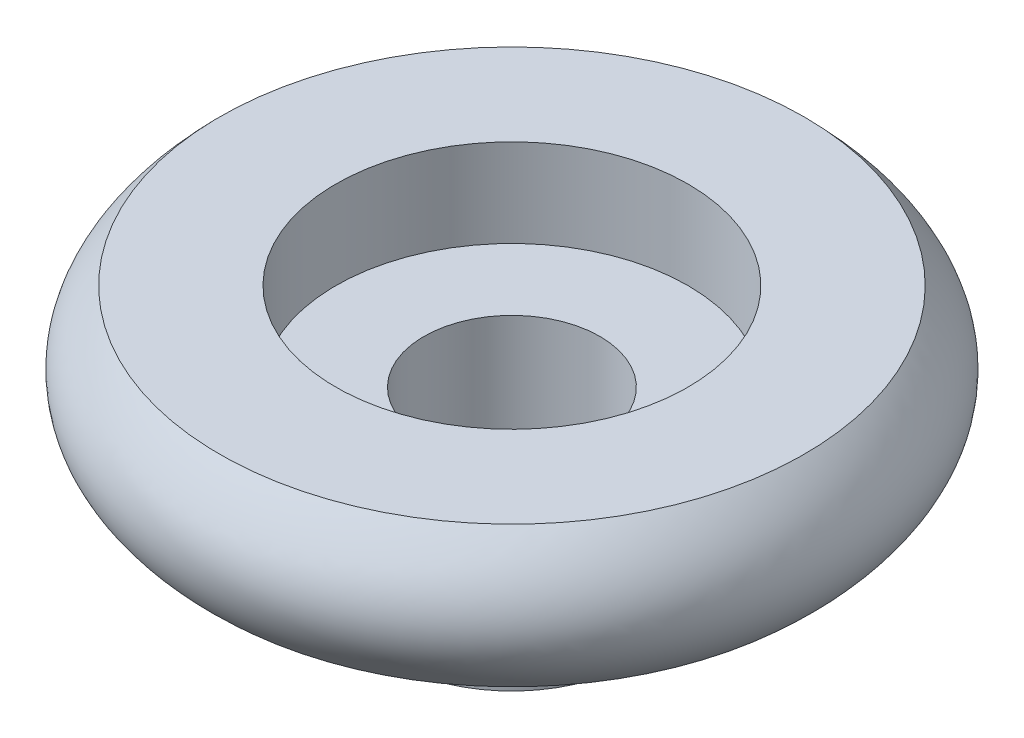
from build123d import *


with BuildPart() as part:
    # Sketch1 → Revolve1 (revolve)
    with BuildSketch(Plane.XY, mode=Mode.PRIVATE) as revolve1_sk:
        with BuildLine():
            Line((3.5, 0.442351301), (3.5, 3.442351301))
            Line((3.5, 3.442351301), (5, 3.442351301))
            Line((5, 3.442351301), (5, 4.442351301))
            Line((5, 4.442351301), (8.3, 4.442351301))
            Line((8.3, 4.442351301), (8.3, 3.942351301))
            add(Edge.make_bspline(
                [(8.3, 7.942351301), (10.422406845, 5.82629467), (8.3, 3.942351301)],
                knots=[0, 0, 0, 1, 1, 1], degree=2))
            Line((8.3, 7.942351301), (5, 7.942351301))
            Line((5, 7.942351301), (5, 5.442351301))
            Line((5, 5.442351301), (2.5, 5.442351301))
            Line((2.5, 5.442351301), (2.5, 0.442351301))
            Line((2.5, 0.442351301), (3.5, 0.442351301))
        make_face()
    revolve(revolve1_sk.sketch.rotate(Axis((0, 0, 0), (0, 1, 0)), 90), axis=Axis((0, 0, 0), (0, 1, 0)))


solid = part.part
